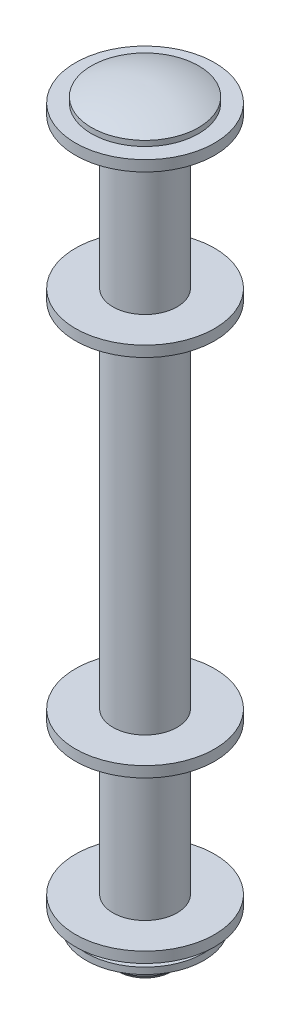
ISO-10303-21;
HEADER;
FILE_DESCRIPTION(('STEP AP214'),'2;1');
FILE_NAME('part.step','',(''),(''),'','','');
FILE_SCHEMA(('AUTOMOTIVE_DESIGN { 1 0 10303 214 1 1 1 1 }'));
ENDSEC;
DATA;
#1=APPLICATION_CONTEXT('core data for automotive mechanical design processes');
#2=APPLICATION_PROTOCOL_DEFINITION('international standard','automotive_design',2000,#1);
#3=PRODUCT_CONTEXT('',#1,'mechanical');
#4=PRODUCT('Part','Part','',(#3));
#5=PRODUCT_RELATED_PRODUCT_CATEGORY('part','',(#4));
#6=PRODUCT_DEFINITION_FORMATION('','',#4);
#7=PRODUCT_DEFINITION_CONTEXT('part definition',#1,'design');
#8=PRODUCT_DEFINITION('design','',#6,#7);
#9=PRODUCT_DEFINITION_SHAPE('','',#8);
#10=(LENGTH_UNIT() NAMED_UNIT(*) SI_UNIT(.MILLI.,.METRE.));
#11=(NAMED_UNIT(*) PLANE_ANGLE_UNIT() SI_UNIT($,.RADIAN.));
#12=(NAMED_UNIT(*) SI_UNIT($,.STERADIAN.) SOLID_ANGLE_UNIT());
#13=UNCERTAINTY_MEASURE_WITH_UNIT(LENGTH_MEASURE(1.E-05),#10,'distance_accuracy_value','');
#14=(GEOMETRIC_REPRESENTATION_CONTEXT(3) GLOBAL_UNCERTAINTY_ASSIGNED_CONTEXT((#13)) GLOBAL_UNIT_ASSIGNED_CONTEXT((#10,
#11,#12)) REPRESENTATION_CONTEXT('',''));
#15=CARTESIAN_POINT('',(0.,0.,0.));
#16=DIRECTION('',(0.,0.,1.));
#17=DIRECTION('',(1.,0.,0.));
#18=AXIS2_PLACEMENT_3D('',#15,#16,#17);
#19=CARTESIAN_POINT('',(6.4999999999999,54.,0.));
#20=DIRECTION('',(0.,1.,0.));
#21=DIRECTION('',(-1.,0.,0.));
#22=AXIS2_PLACEMENT_3D('',#19,#20,#21);
#23=PLANE('',#22);
#24=CARTESIAN_POINT('',(0.,54.,0.));
#25=DIRECTION('',(0.,-1.,0.));
#26=DIRECTION('',(1.,0.,0.));
#27=AXIS2_PLACEMENT_3D('',#24,#25,#26);
#28=CIRCLE('',#27,3.00000000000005);
#29=CARTESIAN_POINT('',(3.,54.,0.));
#30=VERTEX_POINT('',#29);
#31=EDGE_CURVE('E11',#30,#30,#28,.T.);
#32=ORIENTED_EDGE('',*,*,#31,.T.);
#33=EDGE_LOOP('',(#32));
#34=FACE_BOUND('',#33,.T.);
#35=CARTESIAN_POINT('',(0.,54.,0.));
#36=DIRECTION('',(0.,-1.,0.));
#37=DIRECTION('',(1.,0.,0.));
#38=AXIS2_PLACEMENT_3D('',#35,#36,#37);
#39=CIRCLE('',#38,6.49999999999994);
#40=CARTESIAN_POINT('',(6.4999999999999,54.,0.));
#41=VERTEX_POINT('',#40);
#42=EDGE_CURVE('E95',#41,#41,#39,.T.);
#43=ORIENTED_EDGE('',*,*,#42,.F.);
#44=EDGE_LOOP('',(#43));
#45=FACE_BOUND('',#44,.T.);
#46=ADVANCED_FACE('F35',(#34,#45),#23,.T.);
#47=CARTESIAN_POINT('',(0.,0.,0.));
#48=DIRECTION('',(0.,-1.,0.));
#49=DIRECTION('',(1.,0.,0.));
#50=AXIS2_PLACEMENT_3D('',#47,#48,#49);
#51=CYLINDRICAL_SURFACE('',#50,3.00000000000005);
#52=CARTESIAN_POINT('',(0.,68.,0.));
#53=DIRECTION('',(0.,-1.,0.));
#54=DIRECTION('',(1.,0.,0.));
#55=AXIS2_PLACEMENT_3D('',#52,#53,#54);
#56=CIRCLE('',#55,3.00000000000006);
#57=CARTESIAN_POINT('',(3.,68.,0.));
#58=VERTEX_POINT('',#57);
#59=EDGE_CURVE('E41',#58,#58,#56,.T.);
#60=ORIENTED_EDGE('',*,*,#59,.T.);
#61=EDGE_LOOP('',(#60));
#62=FACE_BOUND('',#61,.T.);
#63=ORIENTED_EDGE('',*,*,#31,.F.);
#64=EDGE_LOOP('',(#63));
#65=FACE_BOUND('',#64,.T.);
#66=ADVANCED_FACE('F72',(#62,#65),#51,.T.);
#67=CARTESIAN_POINT('',(6.50000000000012,68.,0.));
#68=DIRECTION('',(0.,-1.,0.));
#69=DIRECTION('',(1.,0.,0.));
#70=AXIS2_PLACEMENT_3D('',#67,#68,#69);
#71=PLANE('',#70);
#72=CARTESIAN_POINT('',(0.,68.,0.));
#73=DIRECTION('',(0.,-1.,0.));
#74=DIRECTION('',(1.,0.,0.));
#75=AXIS2_PLACEMENT_3D('',#72,#73,#74);
#76=CIRCLE('',#75,6.50000000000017);
#77=CARTESIAN_POINT('',(6.50000000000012,68.,0.));
#78=VERTEX_POINT('',#77);
#79=EDGE_CURVE('E67',#78,#78,#76,.T.);
#80=ORIENTED_EDGE('',*,*,#79,.T.);
#81=EDGE_LOOP('',(#80));
#82=FACE_BOUND('',#81,.T.);
#83=ORIENTED_EDGE('',*,*,#59,.F.);
#84=EDGE_LOOP('',(#83));
#85=FACE_BOUND('',#84,.T.);
#86=ADVANCED_FACE('F75',(#82,#85),#71,.T.);
#87=CARTESIAN_POINT('',(0.,0.,0.));
#88=DIRECTION('',(0.,-1.,0.));
#89=DIRECTION('',(1.,0.,0.));
#90=AXIS2_PLACEMENT_3D('',#87,#88,#89);
#91=CYLINDRICAL_SURFACE('',#90,6.50000000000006);
#92=CARTESIAN_POINT('',(0.,69.,0.));
#93=DIRECTION('',(0.,-1.,0.));
#94=DIRECTION('',(1.,0.,0.));
#95=AXIS2_PLACEMENT_3D('',#92,#93,#94);
#96=CIRCLE('',#95,6.49999999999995);
#97=CARTESIAN_POINT('',(6.4999999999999,69.,0.));
#98=VERTEX_POINT('',#97);
#99=EDGE_CURVE('E58',#98,#98,#96,.T.);
#100=ORIENTED_EDGE('',*,*,#99,.T.);
#101=EDGE_LOOP('',(#100));
#102=FACE_BOUND('',#101,.T.);
#103=ORIENTED_EDGE('',*,*,#79,.F.);
#104=EDGE_LOOP('',(#103));
#105=FACE_BOUND('',#104,.T.);
#106=ADVANCED_FACE('F77',(#102,#105),#91,.T.);
#107=CARTESIAN_POINT('',(6.4999999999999,69.,0.));
#108=DIRECTION('',(0.,1.,0.));
#109=DIRECTION('',(-1.,0.,0.));
#110=AXIS2_PLACEMENT_3D('',#107,#108,#109);
#111=PLANE('',#110);
#112=CARTESIAN_POINT('',(0.,69.,0.));
#113=DIRECTION('',(0.,-1.,0.));
#114=DIRECTION('',(1.,0.,0.));
#115=AXIS2_PLACEMENT_3D('',#112,#113,#114);
#116=CIRCLE('',#115,4.99999999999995);
#117=CARTESIAN_POINT('',(4.99999999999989,69.,0.));
#118=VERTEX_POINT('',#117);
#119=EDGE_CURVE('E54',#118,#118,#116,.T.);
#120=ORIENTED_EDGE('',*,*,#119,.T.);
#121=EDGE_LOOP('',(#120));
#122=FACE_BOUND('',#121,.T.);
#123=ORIENTED_EDGE('',*,*,#99,.F.);
#124=EDGE_LOOP('',(#123));
#125=FACE_BOUND('',#124,.T.);
#126=ADVANCED_FACE('F84',(#122,#125),#111,.T.);
#127=CARTESIAN_POINT('',(0.,0.,0.));
#128=DIRECTION('',(0.,-1.,0.));
#129=DIRECTION('',(1.,0.,0.));
#130=AXIS2_PLACEMENT_3D('',#127,#128,#129);
#131=CYLINDRICAL_SURFACE('',#130,4.99999999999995);
#132=CARTESIAN_POINT('',(0.,69.5,0.));
#133=DIRECTION('',(0.,-1.,0.));
#134=DIRECTION('',(1.,0.,0.));
#135=AXIS2_PLACEMENT_3D('',#132,#133,#134);
#136=CIRCLE('',#135,4.99999999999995);
#137=CARTESIAN_POINT('',(4.99999999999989,69.5,0.));
#138=VERTEX_POINT('',#137);
#139=EDGE_CURVE('E52',#138,#138,#136,.T.);
#140=ORIENTED_EDGE('',*,*,#139,.T.);
#141=EDGE_LOOP('',(#140));
#142=FACE_BOUND('',#141,.T.);
#143=ORIENTED_EDGE('',*,*,#119,.F.);
#144=EDGE_LOOP('',(#143));
#145=FACE_BOUND('',#144,.T.);
#146=ADVANCED_FACE('F48',(#142,#145),#131,.T.);
#147=CARTESIAN_POINT('',(0.249999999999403,58.7499999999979,0.));
#148=DIRECTION('',(0.,0.,-1.));
#149=DIRECTION('',(1.,0.,0.));
#150=AXIS2_PLACEMENT_3D('',#147,#148,#149);
#151=CIRCLE('',#150,11.7526592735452);
#152=TRIMMED_CURVE('',#151,(PARAMETER_VALUE(-1.59206971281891)),
(PARAMETER_VALUE(1.59206971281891)),.T.,.PARAMETER.);
#153=CARTESIAN_POINT('',(0.,58.7499999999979,0.));
#154=DIRECTION('',(0.,-1.,0.));
#155=AXIS1_PLACEMENT('',#153,#154);
#156=SURFACE_OF_REVOLUTION('',#152,#155);
#157=CARTESIAN_POINT('',(0.,70.5,0.));
#158=VERTEX_POINT('',#157);
#159=VERTEX_LOOP('',#158);
#160=FACE_BOUND('',#159,.T.);
#161=ORIENTED_EDGE('',*,*,#139,.F.);
#162=EDGE_LOOP('',(#161));
#163=FACE_BOUND('',#162,.T.);
#164=ADVANCED_FACE('F44',(#160,#163),#156,.T.);
#165=CARTESIAN_POINT('',(0.,0.,0.));
#166=DIRECTION('',(0.,-1.,0.));
#167=DIRECTION('',(1.,0.,0.));
#168=AXIS2_PLACEMENT_3D('',#165,#166,#167);
#169=PLANE('',#168);
#170=CARTESIAN_POINT('',(0.,0.,0.));
#171=DIRECTION('',(0.,-1.,0.));
#172=DIRECTION('',(1.,0.,0.));
#173=AXIS2_PLACEMENT_3D('',#170,#171,#172);
#174=CIRCLE('',#173,2.49999999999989);
#175=CARTESIAN_POINT('',(2.49999999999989,0.,0.));
#176=VERTEX_POINT('',#175);
#177=EDGE_CURVE('E55',#176,#176,#174,.T.);
#178=ORIENTED_EDGE('',*,*,#177,.T.);
#179=EDGE_LOOP('',(#178));
#180=FACE_BOUND('',#179,.T.);
#181=ADVANCED_FACE('F47',(#180),#169,.T.);
#182=CARTESIAN_POINT('',(0.,0.,0.));
#183=DIRECTION('',(0.,1.,0.));
#184=DIRECTION('',(-1.,0.,0.));
#185=AXIS2_PLACEMENT_3D('',#182,#183,#184);
#186=CONICAL_SURFACE('',#185,2.49999999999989,0.785398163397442);
#187=CARTESIAN_POINT('',(0.,0.500000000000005,0.));
#188=DIRECTION('',(0.,-1.,0.));
#189=DIRECTION('',(1.,0.,0.));
#190=AXIS2_PLACEMENT_3D('',#187,#188,#189);
#191=CIRCLE('',#190,2.99999999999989);
#192=CARTESIAN_POINT('',(2.99999999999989,0.500000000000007,0.));
#193=VERTEX_POINT('',#192);
#194=EDGE_CURVE('E61',#193,#193,#191,.T.);
#195=ORIENTED_EDGE('',*,*,#194,.T.);
#196=EDGE_LOOP('',(#195));
#197=FACE_BOUND('',#196,.T.);
#198=ORIENTED_EDGE('',*,*,#177,.F.);
#199=EDGE_LOOP('',(#198));
#200=FACE_BOUND('',#199,.T.);
#201=ADVANCED_FACE('F149',(#197,#200),#186,.T.);
#202=CARTESIAN_POINT('',(0.,0.,0.));
#203=DIRECTION('',(0.,-1.,0.));
#204=DIRECTION('',(1.,0.,0.));
#205=AXIS2_PLACEMENT_3D('',#202,#203,#204);
#206=CYLINDRICAL_SURFACE('',#205,2.99999999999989);
#207=CARTESIAN_POINT('',(0.,2.29999999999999,0.));
#208=DIRECTION('',(0.,-1.,0.));
#209=DIRECTION('',(1.,0.,0.));
#210=AXIS2_PLACEMENT_3D('',#207,#208,#209);
#211=CIRCLE('',#210,2.99999999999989);
#212=CARTESIAN_POINT('',(2.99999999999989,2.3,0.));
#213=VERTEX_POINT('',#212);
#214=EDGE_CURVE('E144',#213,#213,#211,.T.);
#215=ORIENTED_EDGE('',*,*,#214,.T.);
#216=EDGE_LOOP('',(#215));
#217=FACE_BOUND('',#216,.T.);
#218=ORIENTED_EDGE('',*,*,#194,.F.);
#219=EDGE_LOOP('',(#218));
#220=FACE_BOUND('',#219,.T.);
#221=ADVANCED_FACE('F152',(#217,#220),#206,.T.);
#222=CARTESIAN_POINT('',(2.99999999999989,2.3,0.));
#223=DIRECTION('',(0.,1.,0.));
#224=DIRECTION('',(-1.,0.,0.));
#225=AXIS2_PLACEMENT_3D('',#222,#223,#224);
#226=PLANE('',#225);
#227=CARTESIAN_POINT('',(0.,2.29999999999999,0.));
#228=DIRECTION('',(0.,-1.,0.));
#229=DIRECTION('',(1.,0.,0.));
#230=AXIS2_PLACEMENT_3D('',#227,#228,#229);
#231=CIRCLE('',#230,2.49999999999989);
#232=CARTESIAN_POINT('',(2.49999999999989,2.3,0.));
#233=VERTEX_POINT('',#232);
#234=EDGE_CURVE('E141',#233,#233,#231,.T.);
#235=ORIENTED_EDGE('',*,*,#234,.T.);
#236=EDGE_LOOP('',(#235));
#237=FACE_BOUND('',#236,.T.);
#238=ORIENTED_EDGE('',*,*,#214,.F.);
#239=EDGE_LOOP('',(#238));
#240=FACE_BOUND('',#239,.T.);
#241=ADVANCED_FACE('F154',(#237,#240),#226,.T.);
#242=CARTESIAN_POINT('',(0.,0.,0.));
#243=DIRECTION('',(0.,-1.,0.));
#244=DIRECTION('',(1.,0.,0.));
#245=AXIS2_PLACEMENT_3D('',#242,#243,#244);
#246=CYLINDRICAL_SURFACE('',#245,2.49999999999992);
#247=CARTESIAN_POINT('',(0.,2.40000000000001,0.));
#248=DIRECTION('',(0.,-1.,0.));
#249=DIRECTION('',(1.,0.,0.));
#250=AXIS2_PLACEMENT_3D('',#247,#248,#249);
#251=CIRCLE('',#250,2.49999999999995);
#252=CARTESIAN_POINT('',(2.49999999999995,2.40000000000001,0.));
#253=VERTEX_POINT('',#252);
#254=EDGE_CURVE('E138',#253,#253,#251,.T.);
#255=ORIENTED_EDGE('',*,*,#254,.T.);
#256=EDGE_LOOP('',(#255));
#257=FACE_BOUND('',#256,.T.);
#258=ORIENTED_EDGE('',*,*,#234,.F.);
#259=EDGE_LOOP('',(#258));
#260=FACE_BOUND('',#259,.T.);
#261=ADVANCED_FACE('F161',(#257,#260),#246,.T.);
#262=CARTESIAN_POINT('',(5.50000000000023,2.40000000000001,0.));
#263=DIRECTION('',(0.,-1.,0.));
#264=DIRECTION('',(1.,0.,0.));
#265=AXIS2_PLACEMENT_3D('',#262,#263,#264);
#266=PLANE('',#265);
#267=CARTESIAN_POINT('',(0.,2.40000000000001,0.));
#268=DIRECTION('',(0.,-1.,0.));
#269=DIRECTION('',(1.,0.,0.));
#270=AXIS2_PLACEMENT_3D('',#267,#268,#269);
#271=CIRCLE('',#270,5.50000000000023);
#272=CARTESIAN_POINT('',(5.50000000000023,2.40000000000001,0.));
#273=VERTEX_POINT('',#272);
#274=EDGE_CURVE('E135',#273,#273,#271,.T.);
#275=ORIENTED_EDGE('',*,*,#274,.T.);
#276=EDGE_LOOP('',(#275));
#277=FACE_BOUND('',#276,.T.);
#278=ORIENTED_EDGE('',*,*,#254,.F.);
#279=EDGE_LOOP('',(#278));
#280=FACE_BOUND('',#279,.T.);
#281=ADVANCED_FACE('F219',(#277,#280),#266,.T.);
#282=CARTESIAN_POINT('',(0.,0.,0.));
#283=DIRECTION('',(0.,-1.,0.));
#284=DIRECTION('',(1.,0.,0.));
#285=AXIS2_PLACEMENT_3D('',#282,#283,#284);
#286=CYLINDRICAL_SURFACE('',#285,5.50000000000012);
#287=CARTESIAN_POINT('',(0.,3.,0.));
#288=DIRECTION('',(0.,-1.,0.));
#289=DIRECTION('',(1.,0.,0.));
#290=AXIS2_PLACEMENT_3D('',#287,#288,#289);
#291=CIRCLE('',#290,5.50000000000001);
#292=CARTESIAN_POINT('',(5.50000000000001,3.,0.));
#293=VERTEX_POINT('',#292);
#294=EDGE_CURVE('E132',#293,#293,#291,.T.);
#295=ORIENTED_EDGE('',*,*,#294,.T.);
#296=EDGE_LOOP('',(#295));
#297=FACE_BOUND('',#296,.T.);
#298=ORIENTED_EDGE('',*,*,#274,.F.);
#299=EDGE_LOOP('',(#298));
#300=FACE_BOUND('',#299,.T.);
#301=ADVANCED_FACE('F228',(#297,#300),#286,.T.);
#302=CARTESIAN_POINT('',(5.50000000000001,3.,0.));
#303=DIRECTION('',(0.,1.,0.));
#304=DIRECTION('',(-1.,0.,0.));
#305=AXIS2_PLACEMENT_3D('',#302,#303,#304);
#306=PLANE('',#305);
#307=CARTESIAN_POINT('',(0.,3.,0.));
#308=DIRECTION('',(0.,-1.,0.));
#309=DIRECTION('',(1.,0.,0.));
#310=AXIS2_PLACEMENT_3D('',#307,#308,#309);
#311=CIRCLE('',#310,2.99999999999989);
#312=CARTESIAN_POINT('',(2.99999999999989,3.,0.));
#313=VERTEX_POINT('',#312);
#314=EDGE_CURVE('E129',#313,#313,#311,.T.);
#315=ORIENTED_EDGE('',*,*,#314,.T.);
#316=EDGE_LOOP('',(#315));
#317=FACE_BOUND('',#316,.T.);
#318=ORIENTED_EDGE('',*,*,#294,.F.);
#319=EDGE_LOOP('',(#318));
#320=FACE_BOUND('',#319,.T.);
#321=ADVANCED_FACE('F238',(#317,#320),#306,.T.);
#322=CARTESIAN_POINT('',(0.,0.,0.));
#323=DIRECTION('',(0.,-1.,0.));
#324=DIRECTION('',(1.,0.,0.));
#325=AXIS2_PLACEMENT_3D('',#322,#323,#324);
#326=CYLINDRICAL_SURFACE('',#325,2.99999999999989);
#327=CARTESIAN_POINT('',(0.,4.00000000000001,0.));
#328=DIRECTION('',(0.,-1.,0.));
#329=DIRECTION('',(1.,0.,0.));
#330=AXIS2_PLACEMENT_3D('',#327,#328,#329);
#331=CIRCLE('',#330,2.99999999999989);
#332=CARTESIAN_POINT('',(2.99999999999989,4.00000000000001,0.));
#333=VERTEX_POINT('',#332);
#334=EDGE_CURVE('E126',#333,#333,#331,.T.);
#335=ORIENTED_EDGE('',*,*,#334,.T.);
#336=EDGE_LOOP('',(#335));
#337=FACE_BOUND('',#336,.T.);
#338=ORIENTED_EDGE('',*,*,#314,.F.);
#339=EDGE_LOOP('',(#338));
#340=FACE_BOUND('',#339,.T.);
#341=ADVANCED_FACE('F248',(#337,#340),#326,.T.);
#342=CARTESIAN_POINT('',(6.50000000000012,4.00000000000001,0.));
#343=DIRECTION('',(0.,-1.,0.));
#344=DIRECTION('',(1.,0.,0.));
#345=AXIS2_PLACEMENT_3D('',#342,#343,#344);
#346=PLANE('',#345);
#347=CARTESIAN_POINT('',(0.,4.00000000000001,0.));
#348=DIRECTION('',(0.,-1.,0.));
#349=DIRECTION('',(1.,0.,0.));
#350=AXIS2_PLACEMENT_3D('',#347,#348,#349);
#351=CIRCLE('',#350,6.50000000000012);
#352=CARTESIAN_POINT('',(6.50000000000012,4.00000000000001,0.));
#353=VERTEX_POINT('',#352);
#354=EDGE_CURVE('E123',#353,#353,#351,.T.);
#355=ORIENTED_EDGE('',*,*,#354,.T.);
#356=EDGE_LOOP('',(#355));
#357=FACE_BOUND('',#356,.T.);
#358=ORIENTED_EDGE('',*,*,#334,.F.);
#359=EDGE_LOOP('',(#358));
#360=FACE_BOUND('',#359,.T.);
#361=ADVANCED_FACE('F258',(#357,#360),#346,.T.);
#362=CARTESIAN_POINT('',(0.,0.,0.));
#363=DIRECTION('',(0.,-1.,0.));
#364=DIRECTION('',(1.,0.,0.));
#365=AXIS2_PLACEMENT_3D('',#362,#363,#364);
#366=CYLINDRICAL_SURFACE('',#365,6.50000000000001);
#367=CARTESIAN_POINT('',(0.,4.99999999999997,0.));
#368=DIRECTION('',(0.,-1.,0.));
#369=DIRECTION('',(1.,0.,0.));
#370=AXIS2_PLACEMENT_3D('',#367,#368,#369);
#371=CIRCLE('',#370,6.4999999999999);
#372=CARTESIAN_POINT('',(6.4999999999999,4.99999999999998,0.));
#373=VERTEX_POINT('',#372);
#374=EDGE_CURVE('E120',#373,#373,#371,.T.);
#375=ORIENTED_EDGE('',*,*,#374,.T.);
#376=EDGE_LOOP('',(#375));
#377=FACE_BOUND('',#376,.T.);
#378=ORIENTED_EDGE('',*,*,#354,.F.);
#379=EDGE_LOOP('',(#378));
#380=FACE_BOUND('',#379,.T.);
#381=ADVANCED_FACE('F268',(#377,#380),#366,.T.);
#382=CARTESIAN_POINT('',(6.4999999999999,4.99999999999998,0.));
#383=DIRECTION('',(0.,1.,0.));
#384=DIRECTION('',(-1.,0.,0.));
#385=AXIS2_PLACEMENT_3D('',#382,#383,#384);
#386=PLANE('',#385);
#387=CARTESIAN_POINT('',(0.,4.99999999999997,0.));
#388=DIRECTION('',(0.,-1.,0.));
#389=DIRECTION('',(1.,0.,0.));
#390=AXIS2_PLACEMENT_3D('',#387,#388,#389);
#391=CIRCLE('',#390,3.00000000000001);
#392=CARTESIAN_POINT('',(3.,4.99999999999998,0.));
#393=VERTEX_POINT('',#392);
#394=EDGE_CURVE('E117',#393,#393,#391,.T.);
#395=ORIENTED_EDGE('',*,*,#394,.T.);
#396=EDGE_LOOP('',(#395));
#397=FACE_BOUND('',#396,.T.);
#398=ORIENTED_EDGE('',*,*,#374,.F.);
#399=EDGE_LOOP('',(#398));
#400=FACE_BOUND('',#399,.T.);
#401=ADVANCED_FACE('F278',(#397,#400),#386,.T.);
#402=CARTESIAN_POINT('',(0.,0.,0.));
#403=DIRECTION('',(0.,-1.,0.));
#404=DIRECTION('',(1.,0.,0.));
#405=AXIS2_PLACEMENT_3D('',#402,#403,#404);
#406=CYLINDRICAL_SURFACE('',#405,3.00000000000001);
#407=CARTESIAN_POINT('',(0.,19.,0.));
#408=DIRECTION('',(0.,-1.,0.));
#409=DIRECTION('',(1.,0.,0.));
#410=AXIS2_PLACEMENT_3D('',#407,#408,#409);
#411=CIRCLE('',#410,3.00000000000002);
#412=CARTESIAN_POINT('',(3.,19.,0.));
#413=VERTEX_POINT('',#412);
#414=EDGE_CURVE('E114',#413,#413,#411,.T.);
#415=ORIENTED_EDGE('',*,*,#414,.T.);
#416=EDGE_LOOP('',(#415));
#417=FACE_BOUND('',#416,.T.);
#418=ORIENTED_EDGE('',*,*,#394,.F.);
#419=EDGE_LOOP('',(#418));
#420=FACE_BOUND('',#419,.T.);
#421=ADVANCED_FACE('F288',(#417,#420),#406,.T.);
#422=CARTESIAN_POINT('',(6.50000000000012,19.,0.));
#423=DIRECTION('',(0.,-1.,0.));
#424=DIRECTION('',(1.,0.,0.));
#425=AXIS2_PLACEMENT_3D('',#422,#423,#424);
#426=PLANE('',#425);
#427=CARTESIAN_POINT('',(0.,19.,0.));
#428=DIRECTION('',(0.,-1.,0.));
#429=DIRECTION('',(1.,0.,0.));
#430=AXIS2_PLACEMENT_3D('',#427,#428,#429);
#431=CIRCLE('',#430,6.50000000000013);
#432=CARTESIAN_POINT('',(6.50000000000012,19.,0.));
#433=VERTEX_POINT('',#432);
#434=EDGE_CURVE('E111',#433,#433,#431,.T.);
#435=ORIENTED_EDGE('',*,*,#434,.T.);
#436=EDGE_LOOP('',(#435));
#437=FACE_BOUND('',#436,.T.);
#438=ORIENTED_EDGE('',*,*,#414,.F.);
#439=EDGE_LOOP('',(#438));
#440=FACE_BOUND('',#439,.T.);
#441=ADVANCED_FACE('F298',(#437,#440),#426,.T.);
#442=CARTESIAN_POINT('',(0.,0.,0.));
#443=DIRECTION('',(0.,-1.,0.));
#444=DIRECTION('',(1.,0.,0.));
#445=AXIS2_PLACEMENT_3D('',#442,#443,#444);
#446=CYLINDRICAL_SURFACE('',#445,6.50000000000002);
#447=CARTESIAN_POINT('',(0.,20.,0.));
#448=DIRECTION('',(0.,-1.,0.));
#449=DIRECTION('',(1.,0.,0.));
#450=AXIS2_PLACEMENT_3D('',#447,#448,#449);
#451=CIRCLE('',#450,6.49999999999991);
#452=CARTESIAN_POINT('',(6.4999999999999,20.,0.));
#453=VERTEX_POINT('',#452);
#454=EDGE_CURVE('E108',#453,#453,#451,.T.);
#455=ORIENTED_EDGE('',*,*,#454,.T.);
#456=EDGE_LOOP('',(#455));
#457=FACE_BOUND('',#456,.T.);
#458=ORIENTED_EDGE('',*,*,#434,.F.);
#459=EDGE_LOOP('',(#458));
#460=FACE_BOUND('',#459,.T.);
#461=ADVANCED_FACE('F308',(#457,#460),#446,.T.);
#462=CARTESIAN_POINT('',(6.4999999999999,20.,0.));
#463=DIRECTION('',(0.,1.,0.));
#464=DIRECTION('',(-1.,0.,0.));
#465=AXIS2_PLACEMENT_3D('',#462,#463,#464);
#466=PLANE('',#465);
#467=CARTESIAN_POINT('',(0.,20.,0.));
#468=DIRECTION('',(0.,-1.,0.));
#469=DIRECTION('',(1.,0.,0.));
#470=AXIS2_PLACEMENT_3D('',#467,#468,#469);
#471=CIRCLE('',#470,3.00000000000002);
#472=CARTESIAN_POINT('',(3.,20.,0.));
#473=VERTEX_POINT('',#472);
#474=EDGE_CURVE('E105',#473,#473,#471,.T.);
#475=ORIENTED_EDGE('',*,*,#474,.T.);
#476=EDGE_LOOP('',(#475));
#477=FACE_BOUND('',#476,.T.);
#478=ORIENTED_EDGE('',*,*,#454,.F.);
#479=EDGE_LOOP('',(#478));
#480=FACE_BOUND('',#479,.T.);
#481=ADVANCED_FACE('F318',(#477,#480),#466,.T.);
#482=CARTESIAN_POINT('',(0.,0.,0.));
#483=DIRECTION('',(0.,-1.,0.));
#484=DIRECTION('',(1.,0.,0.));
#485=AXIS2_PLACEMENT_3D('',#482,#483,#484);
#486=CYLINDRICAL_SURFACE('',#485,3.00000000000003);
#487=CARTESIAN_POINT('',(0.,53.,0.));
#488=DIRECTION('',(0.,-1.,0.));
#489=DIRECTION('',(1.,0.,0.));
#490=AXIS2_PLACEMENT_3D('',#487,#488,#489);
#491=CIRCLE('',#490,3.00000000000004);
#492=CARTESIAN_POINT('',(3.,53.,0.));
#493=VERTEX_POINT('',#492);
#494=EDGE_CURVE('E100',#493,#493,#491,.T.);
#495=ORIENTED_EDGE('',*,*,#494,.T.);
#496=EDGE_LOOP('',(#495));
#497=FACE_BOUND('',#496,.T.);
#498=ORIENTED_EDGE('',*,*,#474,.F.);
#499=EDGE_LOOP('',(#498));
#500=FACE_BOUND('',#499,.T.);
#501=ADVANCED_FACE('F328',(#497,#500),#486,.T.);
#502=CARTESIAN_POINT('',(6.50000000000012,53.,0.));
#503=DIRECTION('',(0.,-1.,0.));
#504=DIRECTION('',(1.,0.,0.));
#505=AXIS2_PLACEMENT_3D('',#502,#503,#504);
#506=PLANE('',#505);
#507=CARTESIAN_POINT('',(0.,53.,0.));
#508=DIRECTION('',(0.,-1.,0.));
#509=DIRECTION('',(1.,0.,0.));
#510=AXIS2_PLACEMENT_3D('',#507,#508,#509);
#511=CIRCLE('',#510,6.50000000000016);
#512=CARTESIAN_POINT('',(6.50000000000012,53.,0.));
#513=VERTEX_POINT('',#512);
#514=EDGE_CURVE('E97',#513,#513,#511,.T.);
#515=ORIENTED_EDGE('',*,*,#514,.T.);
#516=EDGE_LOOP('',(#515));
#517=FACE_BOUND('',#516,.T.);
#518=ORIENTED_EDGE('',*,*,#494,.F.);
#519=EDGE_LOOP('',(#518));
#520=FACE_BOUND('',#519,.T.);
#521=ADVANCED_FACE('F338',(#517,#520),#506,.T.);
#522=CARTESIAN_POINT('',(0.,0.,0.));
#523=DIRECTION('',(0.,-1.,0.));
#524=DIRECTION('',(1.,0.,0.));
#525=AXIS2_PLACEMENT_3D('',#522,#523,#524);
#526=CYLINDRICAL_SURFACE('',#525,6.50000000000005);
#527=ORIENTED_EDGE('',*,*,#42,.T.);
#528=EDGE_LOOP('',(#527));
#529=FACE_BOUND('',#528,.T.);
#530=ORIENTED_EDGE('',*,*,#514,.F.);
#531=EDGE_LOOP('',(#530));
#532=FACE_BOUND('',#531,.T.);
#533=ADVANCED_FACE('F348',(#529,#532),#526,.T.);
#534=CLOSED_SHELL('',(#46,#66,#86,#106,#126,#146,#164,#181,#201,#221,#241,#261,#281,#301,#321,
#341,#361,#381,#401,#421,#441,#461,#481,#501,#521,#533));
#535=MANIFOLD_SOLID_BREP('B2',#534);
#536=ADVANCED_BREP_SHAPE_REPRESENTATION('',(#18,#535),#14);
#537=SHAPE_DEFINITION_REPRESENTATION(#9,#536);
ENDSEC;
END-ISO-10303-21;
